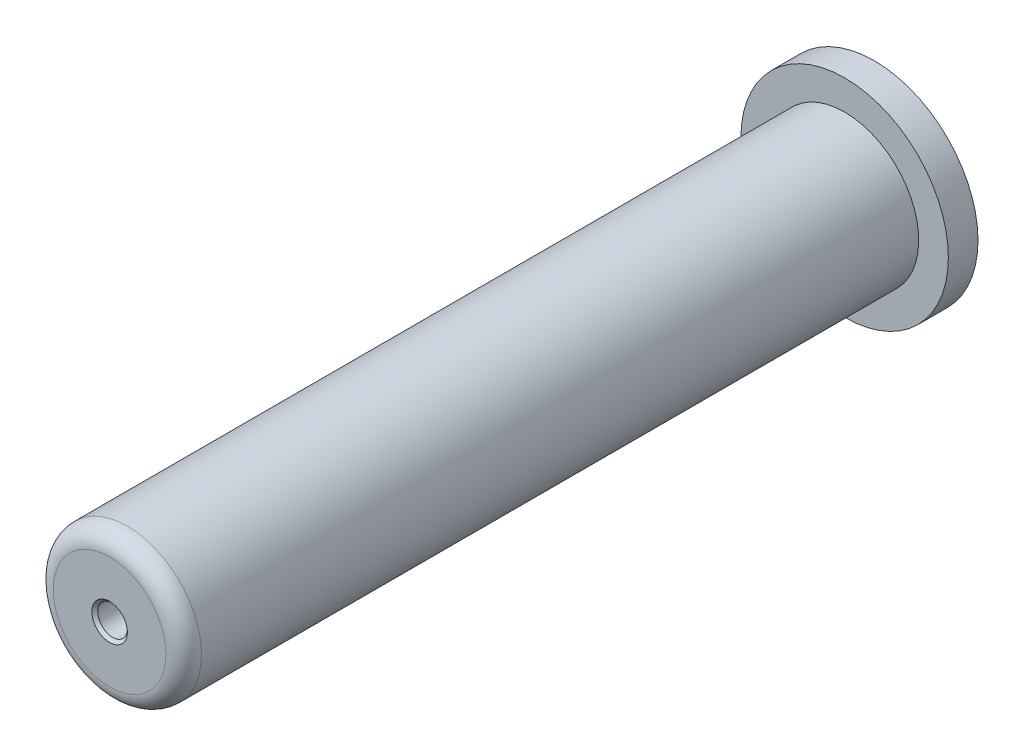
from build123d import *


with BuildPart() as part:
    # Sketch1 → Revolve1 (revolve)
    with BuildSketch(Plane(origin=(0, 0, 0), x_dir=(0, 0, -1), z_dir=(1, 0, 0))):
        with BuildLine():
            Line((0, 0), (0, 17.5))
            Line((0, 17.5), (-5, 17.5))
            Line((-5, 17.5), (-5, 12.5))
            Line((-5, 12.5), (-126, 12.5))
            ThreePointArc((-126, 12.5), (-128.121320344, 11.621320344), (-129, 9.5))
            Line((-129, 9.5), (-129, 3))
            Line((-129, 3), (-128.5, 2.5))
            Line((-128.5, 2.5), (-123, 2.5))
            Line((-123, 2.5), (-121.249481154, 0))
            Line((-121.249481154, 0), (0, 0))
        make_face()
    revolve(axis=Axis((0, 0, 0), (0, 0, 1)))


solid = part.part
